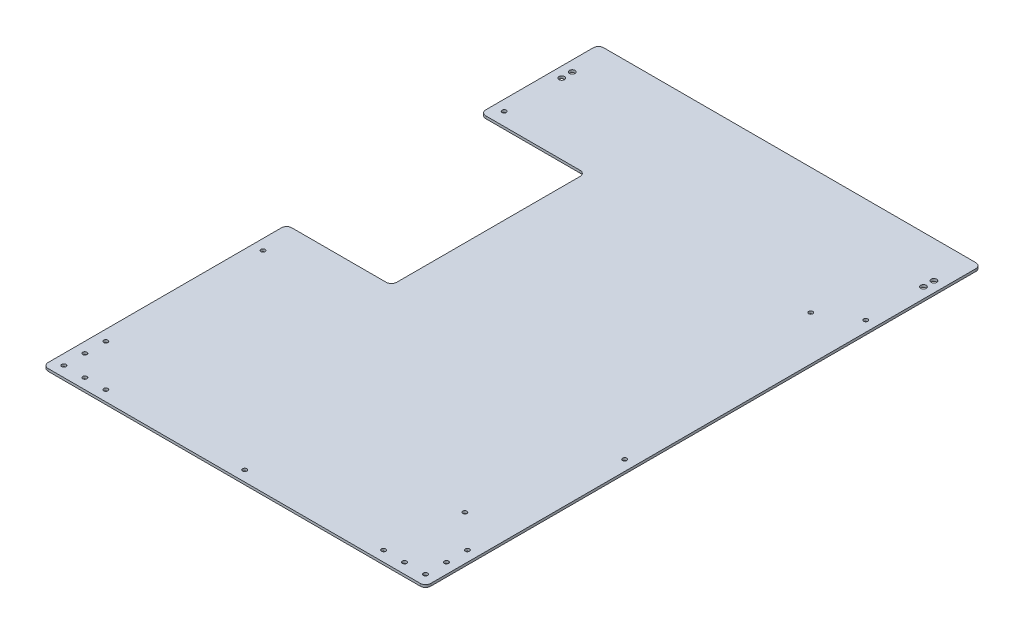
from build123d import *

# Parameters (mm, degrees)
BOSS_EXTRUDE1_DEPTH              = 2.9972
FILLET1_R                        = 6.35
F_7_0_201_DIAMETER_HOLE1_D       = 5.1054
F_7_0_201_DIAMETER_HOLE2_D       = 5.1054
F_17_64_0_26563_DIAMETER_HOLE1_D = 6.747002


with BuildPart() as part:
    # Sketch1 → Boss-Extrude1 (new body)
    with BuildSketch(Plane(origin=(0, 0, 0), x_dir=(1, 0, 0), z_dir=(0, 1, 0))):
        Polygon((-231.775, 336.55), (-231.775, 193.675), (-104.775, 193.675), (-104.775, -41.275), (-231.775, -41.275), (-231.775, -336.55), (231.775, -336.55), (231.775, 336.55), align=None)
    extrude(amount=BOSS_EXTRUDE1_DEPTH)

    # Fillet1
    fillet1_edges = [part.edges().sort_by_distance(p)[0] for p in [
        (-104.775, 1.4986, -193.675),
        (-231.775, 1.4986, -193.675),
        (-231.775, 1.4986, -336.55),
        (231.775, 1.4986, -336.55),
        (231.775, 1.4986, 336.55),
        (-231.775, 1.4986, 336.55),
        (-231.775, 1.4986, 41.275),
        (-104.775, 1.4986, 41.275),
    ]]
    fillet(fillet1_edges, radius=FILLET1_R)

    # 7 _0.201_ Diameter Hole1 (through all)
    with Locations(Plane(origin=(0, 2.9972, 0), x_dir=(1, 0, 0), z_dir=(0, 1, 0))):
        with Locations((177.8, 184.15), (177.8, -234.95)):
            Hole(F_7_0_201_DIAMETER_HOLE1_D / 2)

    # 7 _0.201_ Diameter Hole2 (through all)
    with Locations(Plane(origin=(0, 2.9972, 0), x_dir=(1, 0, 0), z_dir=(0, 1, 0))):
        with Locations((-219.075, -323.85), (-219.075, -298.45), (-219.075, -273.05), (-193.675, -323.85), (-168.275, -323.85), (168.275, -323.85), (193.675, -323.85), (219.075, -323.85), (219.075, -298.45), (219.075, -273.05), (-219.075, -82.55), (-219.075, 209.55), (219.075, 209.55), (219.075, -82.55), (0, -323.85)):
            Hole(F_7_0_201_DIAMETER_HOLE2_D / 2)

    # 17_64 _0.26563_ Diameter Hole1 (through all)
    with Locations(Plane(origin=(0, 2.9972, 0), x_dir=(1, 0, 0), z_dir=(0, 1, 0))):
        with Locations((219.075, 279.4), (219.075, 292.1), (-219.075, 279.4), (-219.075, 292.1)):
            Hole(F_17_64_0_26563_DIAMETER_HOLE1_D / 2)


solid = part.part
